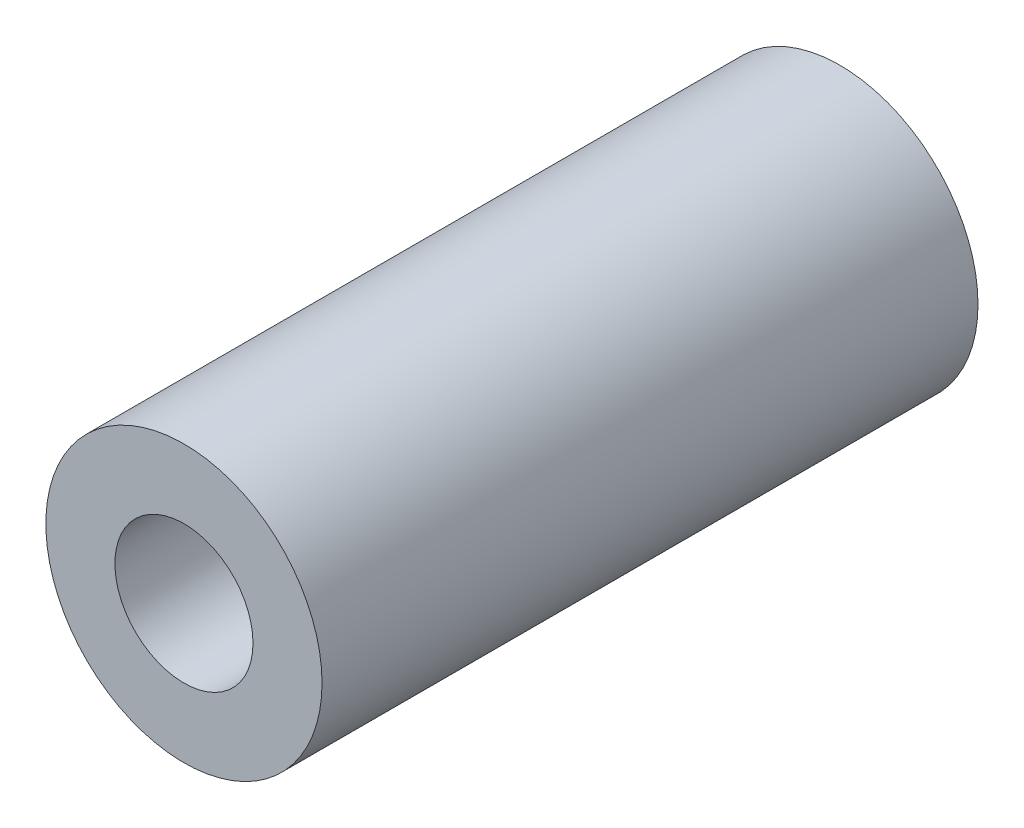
ISO-10303-21;
HEADER;
FILE_DESCRIPTION(('STEP AP214'),'2;1');
FILE_NAME('part.step','',(''),(''),'','','');
FILE_SCHEMA(('AUTOMOTIVE_DESIGN { 1 0 10303 214 1 1 1 1 }'));
ENDSEC;
DATA;
#1=APPLICATION_CONTEXT('core data for automotive mechanical design processes');
#2=APPLICATION_PROTOCOL_DEFINITION('international standard','automotive_design',2000,#1);
#3=PRODUCT_CONTEXT('',#1,'mechanical');
#4=PRODUCT('Part','Part','',(#3));
#5=PRODUCT_RELATED_PRODUCT_CATEGORY('part','',(#4));
#6=PRODUCT_DEFINITION_FORMATION('','',#4);
#7=PRODUCT_DEFINITION_CONTEXT('part definition',#1,'design');
#8=PRODUCT_DEFINITION('design','',#6,#7);
#9=PRODUCT_DEFINITION_SHAPE('','',#8);
#10=(LENGTH_UNIT() NAMED_UNIT(*) SI_UNIT(.MILLI.,.METRE.));
#11=(NAMED_UNIT(*) PLANE_ANGLE_UNIT() SI_UNIT($,.RADIAN.));
#12=(NAMED_UNIT(*) SI_UNIT($,.STERADIAN.) SOLID_ANGLE_UNIT());
#13=UNCERTAINTY_MEASURE_WITH_UNIT(LENGTH_MEASURE(1.E-05),#10,'distance_accuracy_value','');
#14=(GEOMETRIC_REPRESENTATION_CONTEXT(3) GLOBAL_UNCERTAINTY_ASSIGNED_CONTEXT((#13)) GLOBAL_UNIT_ASSIGNED_CONTEXT((#10,
#11,#12)) REPRESENTATION_CONTEXT('',''));
#15=CARTESIAN_POINT('',(0.,0.,0.));
#16=DIRECTION('',(0.,0.,1.));
#17=DIRECTION('',(1.,0.,0.));
#18=AXIS2_PLACEMENT_3D('',#15,#16,#17);
#19=CARTESIAN_POINT('',(0.,0.,9.5));
#20=DIRECTION('',(0.,0.,1.));
#21=DIRECTION('',(1.,0.,0.));
#22=AXIS2_PLACEMENT_3D('',#19,#20,#21);
#23=PLANE('',#22);
#24=CARTESIAN_POINT('',(0.,0.,9.5));
#25=DIRECTION('',(0.,0.,1.));
#26=DIRECTION('',(1.,0.,0.));
#27=AXIS2_PLACEMENT_3D('',#24,#25,#26);
#28=CIRCLE('',#27,2.);
#29=CARTESIAN_POINT('',(2.,0.,9.5));
#30=VERTEX_POINT('',#29);
#31=EDGE_CURVE('E10',#30,#30,#28,.T.);
#32=ORIENTED_EDGE('',*,*,#31,.T.);
#33=EDGE_LOOP('',(#32));
#34=FACE_BOUND('',#33,.T.);
#35=CARTESIAN_POINT('',(0.,0.,9.5));
#36=DIRECTION('',(0.,0.,1.));
#37=DIRECTION('',(1.,0.,0.));
#38=AXIS2_PLACEMENT_3D('',#35,#36,#37);
#39=CIRCLE('',#38,1.);
#40=CARTESIAN_POINT('',(1.,0.,9.5));
#41=VERTEX_POINT('',#40);
#42=EDGE_CURVE('E44',#41,#41,#39,.T.);
#43=ORIENTED_EDGE('',*,*,#42,.F.);
#44=EDGE_LOOP('',(#43));
#45=FACE_BOUND('',#44,.T.);
#46=ADVANCED_FACE('F33',(#34,#45),#23,.T.);
#47=CARTESIAN_POINT('',(0.,0.,0.));
#48=DIRECTION('',(0.,0.,1.));
#49=DIRECTION('',(1.,0.,0.));
#50=AXIS2_PLACEMENT_3D('',#47,#48,#49);
#51=PLANE('',#50);
#52=CARTESIAN_POINT('',(0.,0.,0.));
#53=DIRECTION('',(0.,0.,1.));
#54=DIRECTION('',(1.,0.,0.));
#55=AXIS2_PLACEMENT_3D('',#52,#53,#54);
#56=CIRCLE('',#55,2.);
#57=CARTESIAN_POINT('',(2.,0.,0.));
#58=VERTEX_POINT('',#57);
#59=EDGE_CURVE('E37',#58,#58,#56,.T.);
#60=ORIENTED_EDGE('',*,*,#59,.F.);
#61=EDGE_LOOP('',(#60));
#62=FACE_BOUND('',#61,.T.);
#63=CARTESIAN_POINT('',(0.,0.,0.));
#64=DIRECTION('',(0.,0.,1.));
#65=DIRECTION('',(1.,0.,0.));
#66=AXIS2_PLACEMENT_3D('',#63,#64,#65);
#67=CIRCLE('',#66,1.);
#68=CARTESIAN_POINT('',(1.,0.,0.));
#69=VERTEX_POINT('',#68);
#70=EDGE_CURVE('E46',#69,#69,#67,.T.);
#71=ORIENTED_EDGE('',*,*,#70,.T.);
#72=EDGE_LOOP('',(#71));
#73=FACE_BOUND('',#72,.T.);
#74=ADVANCED_FACE('F56',(#62,#73),#51,.F.);
#75=CARTESIAN_POINT('',(0.,0.,9.5));
#76=DIRECTION('',(0.,0.,-1.));
#77=DIRECTION('',(-1.,0.,0.));
#78=AXIS2_PLACEMENT_3D('',#75,#76,#77);
#79=CYLINDRICAL_SURFACE('',#78,2.);
#80=ORIENTED_EDGE('',*,*,#31,.F.);
#81=EDGE_LOOP('',(#80));
#82=FACE_BOUND('',#81,.T.);
#83=ORIENTED_EDGE('',*,*,#59,.T.);
#84=EDGE_LOOP('',(#83));
#85=FACE_BOUND('',#84,.T.);
#86=ADVANCED_FACE('F35',(#82,#85),#79,.T.);
#87=CARTESIAN_POINT('',(0.,0.,9.5));
#88=DIRECTION('',(0.,0.,-1.));
#89=DIRECTION('',(-1.,0.,0.));
#90=AXIS2_PLACEMENT_3D('',#87,#88,#89);
#91=CYLINDRICAL_SURFACE('',#90,1.);
#92=ORIENTED_EDGE('',*,*,#42,.T.);
#93=EDGE_LOOP('',(#92));
#94=FACE_BOUND('',#93,.T.);
#95=ORIENTED_EDGE('',*,*,#70,.F.);
#96=EDGE_LOOP('',(#95));
#97=FACE_BOUND('',#96,.T.);
#98=ADVANCED_FACE('F52',(#94,#97),#91,.F.);
#99=CLOSED_SHELL('',(#46,#74,#86,#98));
#100=MANIFOLD_SOLID_BREP('B2',#99);
#101=ADVANCED_BREP_SHAPE_REPRESENTATION('',(#18,#100),#14);
#102=SHAPE_DEFINITION_REPRESENTATION(#9,#101);
ENDSEC;
END-ISO-10303-21;
